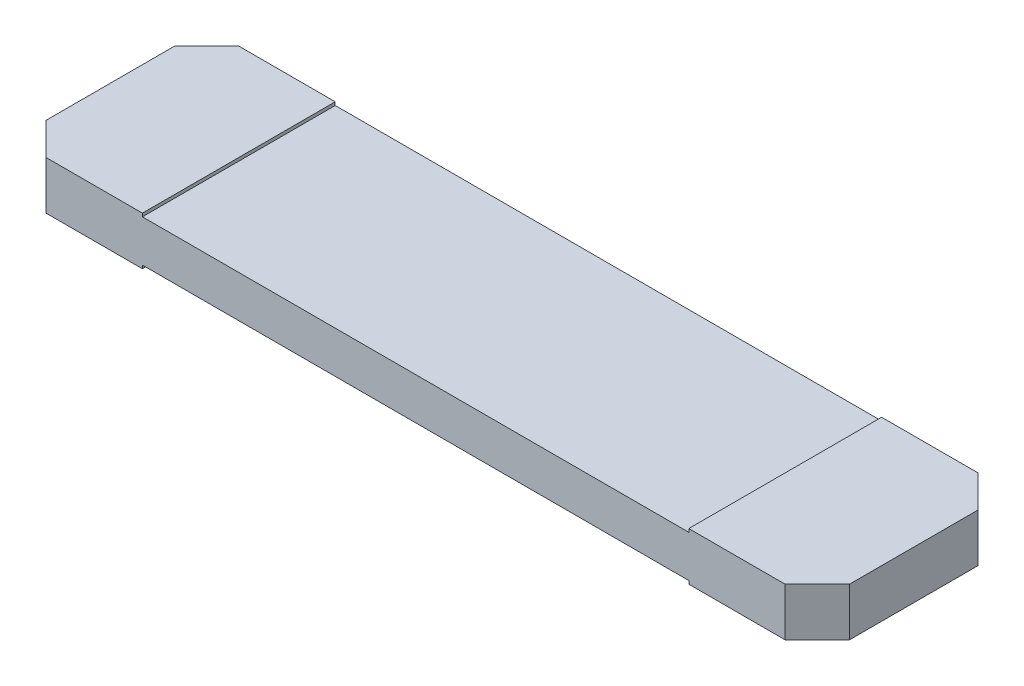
ISO-10303-21;
HEADER;
FILE_DESCRIPTION(('STEP AP214'),'2;1');
FILE_NAME('part.step','',(''),(''),'','','');
FILE_SCHEMA(('AUTOMOTIVE_DESIGN { 1 0 10303 214 1 1 1 1 }'));
ENDSEC;
DATA;
#1=APPLICATION_CONTEXT('core data for automotive mechanical design processes');
#2=APPLICATION_PROTOCOL_DEFINITION('international standard','automotive_design',2000,#1);
#3=PRODUCT_CONTEXT('',#1,'mechanical');
#4=PRODUCT('Part','Part','',(#3));
#5=PRODUCT_RELATED_PRODUCT_CATEGORY('part','',(#4));
#6=PRODUCT_DEFINITION_FORMATION('','',#4);
#7=PRODUCT_DEFINITION_CONTEXT('part definition',#1,'design');
#8=PRODUCT_DEFINITION('design','',#6,#7);
#9=PRODUCT_DEFINITION_SHAPE('','',#8);
#10=(LENGTH_UNIT() NAMED_UNIT(*) SI_UNIT(.MILLI.,.METRE.));
#11=(NAMED_UNIT(*) PLANE_ANGLE_UNIT() SI_UNIT($,.RADIAN.));
#12=(NAMED_UNIT(*) SI_UNIT($,.STERADIAN.) SOLID_ANGLE_UNIT());
#13=UNCERTAINTY_MEASURE_WITH_UNIT(LENGTH_MEASURE(1.E-05),#10,'distance_accuracy_value','');
#14=(GEOMETRIC_REPRESENTATION_CONTEXT(3) GLOBAL_UNCERTAINTY_ASSIGNED_CONTEXT((#13)) GLOBAL_UNIT_ASSIGNED_CONTEXT((#10,
#11,#12)) REPRESENTATION_CONTEXT('',''));
#15=CARTESIAN_POINT('',(0.,0.,0.));
#16=DIRECTION('',(0.,0.,1.));
#17=DIRECTION('',(1.,0.,0.));
#18=AXIS2_PLACEMENT_3D('',#15,#16,#17);
#19=CARTESIAN_POINT('',(-12.5,-0.75,-3.));
#20=DIRECTION('',(0.,-1.,0.));
#21=DIRECTION('',(0.,0.,-1.));
#22=AXIS2_PLACEMENT_3D('',#19,#20,#21);
#23=PLANE('',#22);
#24=DIRECTION('',(0.,0.,1.));
#25=VECTOR('',#24,1.);
#26=CARTESIAN_POINT('',(8.5,-0.75,-3.));
#27=LINE('',#26,#25);
#28=CARTESIAN_POINT('',(8.5,-0.75,-3.));
#29=VERTEX_POINT('',#28);
#30=CARTESIAN_POINT('',(8.5,-0.75,3.));
#31=VERTEX_POINT('',#30);
#32=EDGE_CURVE('E38',#29,#31,#27,.T.);
#33=ORIENTED_EDGE('',*,*,#32,.F.);
#34=DIRECTION('',(-1.,0.,0.));
#35=VECTOR('',#34,1.);
#36=CARTESIAN_POINT('',(-11.5,-0.75,-3.));
#37=LINE('',#36,#35);
#38=CARTESIAN_POINT('',(11.5,-0.75,-3.));
#39=VERTEX_POINT('',#38);
#40=EDGE_CURVE('E165',#39,#29,#37,.T.);
#41=ORIENTED_EDGE('',*,*,#40,.F.);
#42=DIRECTION('',(-0.707106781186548,0.,-0.707106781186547));
#43=VECTOR('',#42,1.);
#44=CARTESIAN_POINT('',(11.5,-0.75,-3.));
#45=LINE('',#44,#43);
#46=CARTESIAN_POINT('',(12.5,-0.75,-2.));
#47=VERTEX_POINT('',#46);
#48=EDGE_CURVE('E206',#47,#39,#45,.T.);
#49=ORIENTED_EDGE('',*,*,#48,.F.);
#50=DIRECTION('',(0.,0.,-1.));
#51=VECTOR('',#50,1.);
#52=CARTESIAN_POINT('',(12.5,-0.75,2.));
#53=LINE('',#52,#51);
#54=CARTESIAN_POINT('',(12.5,-0.75,2.));
#55=VERTEX_POINT('',#54);
#56=EDGE_CURVE('E204',#55,#47,#53,.T.);
#57=ORIENTED_EDGE('',*,*,#56,.F.);
#58=DIRECTION('',(0.707106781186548,0.,-0.707106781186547));
#59=VECTOR('',#58,1.);
#60=CARTESIAN_POINT('',(11.5,-0.75,3.));
#61=LINE('',#60,#59);
#62=CARTESIAN_POINT('',(11.5,-0.75,3.));
#63=VERTEX_POINT('',#62);
#64=EDGE_CURVE('E202',#63,#55,#61,.T.);
#65=ORIENTED_EDGE('',*,*,#64,.F.);
#66=DIRECTION('',(1.,0.,0.));
#67=VECTOR('',#66,1.);
#68=CARTESIAN_POINT('',(-11.5,-0.75,3.));
#69=LINE('',#68,#67);
#70=EDGE_CURVE('E198',#31,#63,#69,.T.);
#71=ORIENTED_EDGE('',*,*,#70,.F.);
#72=EDGE_LOOP('',(#33,#41,#49,#57,#65,#71));
#73=FACE_BOUND('',#72,.T.);
#74=ADVANCED_FACE('F30',(#73),#23,.T.);
#75=CARTESIAN_POINT('',(-12.5,0.75,-3.));
#76=DIRECTION('',(0.,-1.,0.));
#77=DIRECTION('',(0.,0.,-1.));
#78=AXIS2_PLACEMENT_3D('',#75,#76,#77);
#79=PLANE('',#78);
#80=DIRECTION('',(1.,0.,0.));
#81=VECTOR('',#80,1.);
#82=CARTESIAN_POINT('',(-11.5,0.75,3.));
#83=LINE('',#82,#81);
#84=CARTESIAN_POINT('',(-11.5,0.75,3.));
#85=VERTEX_POINT('',#84);
#86=CARTESIAN_POINT('',(-8.5,0.75,3.));
#87=VERTEX_POINT('',#86);
#88=EDGE_CURVE('E218',#85,#87,#83,.T.);
#89=ORIENTED_EDGE('',*,*,#88,.T.);
#90=DIRECTION('',(0.,0.,-1.));
#91=VECTOR('',#90,1.);
#92=CARTESIAN_POINT('',(-8.5,0.75,-3.));
#93=LINE('',#92,#91);
#94=CARTESIAN_POINT('',(-8.5,0.75,-3.));
#95=VERTEX_POINT('',#94);
#96=EDGE_CURVE('E258',#87,#95,#93,.T.);
#97=ORIENTED_EDGE('',*,*,#96,.T.);
#98=DIRECTION('',(-1.,0.,0.));
#99=VECTOR('',#98,1.);
#100=CARTESIAN_POINT('',(-11.5,0.75,-3.));
#101=LINE('',#100,#99);
#102=CARTESIAN_POINT('',(-11.5,0.75,-3.));
#103=VERTEX_POINT('',#102);
#104=EDGE_CURVE('E227',#95,#103,#101,.T.);
#105=ORIENTED_EDGE('',*,*,#104,.T.);
#106=DIRECTION('',(-0.707106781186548,0.,0.707106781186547));
#107=VECTOR('',#106,1.);
#108=CARTESIAN_POINT('',(-12.5,0.75,-2.));
#109=LINE('',#108,#107);
#110=CARTESIAN_POINT('',(-12.5,0.75,-2.));
#111=VERTEX_POINT('',#110);
#112=EDGE_CURVE('E231',#103,#111,#109,.T.);
#113=ORIENTED_EDGE('',*,*,#112,.T.);
#114=DIRECTION('',(0.,0.,1.));
#115=VECTOR('',#114,1.);
#116=CARTESIAN_POINT('',(-12.5,0.75,2.));
#117=LINE('',#116,#115);
#118=CARTESIAN_POINT('',(-12.5,0.75,2.));
#119=VERTEX_POINT('',#118);
#120=EDGE_CURVE('E212',#111,#119,#117,.T.);
#121=ORIENTED_EDGE('',*,*,#120,.T.);
#122=DIRECTION('',(0.707106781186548,0.,0.707106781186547));
#123=VECTOR('',#122,1.);
#124=CARTESIAN_POINT('',(-12.5,0.75,2.));
#125=LINE('',#124,#123);
#126=EDGE_CURVE('E215',#119,#85,#125,.T.);
#127=ORIENTED_EDGE('',*,*,#126,.T.);
#128=EDGE_LOOP('',(#89,#97,#105,#113,#121,#127));
#129=FACE_BOUND('',#128,.T.);
#130=ADVANCED_FACE('F297',(#129),#79,.F.);
#131=CARTESIAN_POINT('',(-12.5,0.75,2.));
#132=DIRECTION('',(1.,0.,0.));
#133=DIRECTION('',(0.,0.,-1.));
#134=AXIS2_PLACEMENT_3D('',#131,#132,#133);
#135=PLANE('',#134);
#136=DIRECTION('',(0.,0.,1.));
#137=VECTOR('',#136,1.);
#138=CARTESIAN_POINT('',(-12.5,-0.75,2.));
#139=LINE('',#138,#137);
#140=CARTESIAN_POINT('',(-12.5,-0.75,-2.));
#141=VERTEX_POINT('',#140);
#142=CARTESIAN_POINT('',(-12.5,-0.75,2.));
#143=VERTEX_POINT('',#142);
#144=EDGE_CURVE('E193',#141,#143,#139,.T.);
#145=ORIENTED_EDGE('',*,*,#144,.T.);
#146=DIRECTION('',(0.,-1.,0.));
#147=VECTOR('',#146,1.);
#148=CARTESIAN_POINT('',(-12.5,0.75,2.));
#149=LINE('',#148,#147);
#150=EDGE_CURVE('E253',#119,#143,#149,.T.);
#151=ORIENTED_EDGE('',*,*,#150,.F.);
#152=ORIENTED_EDGE('',*,*,#120,.F.);
#153=DIRECTION('',(0.,-1.,0.));
#154=VECTOR('',#153,1.);
#155=CARTESIAN_POINT('',(-12.5,0.75,-2.));
#156=LINE('',#155,#154);
#157=EDGE_CURVE('E233',#111,#141,#156,.T.);
#158=ORIENTED_EDGE('',*,*,#157,.T.);
#159=EDGE_LOOP('',(#145,#151,#152,#158));
#160=FACE_BOUND('',#159,.T.);
#161=ADVANCED_FACE('F32',(#160),#135,.F.);
#162=CARTESIAN_POINT('',(-12.5,0.75,2.));
#163=DIRECTION('',(0.707106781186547,0.,-0.707106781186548));
#164=DIRECTION('',(-0.707106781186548,0.,-0.707106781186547));
#165=AXIS2_PLACEMENT_3D('',#162,#163,#164);
#166=PLANE('',#165);
#167=DIRECTION('',(0.707106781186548,0.,0.707106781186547));
#168=VECTOR('',#167,1.);
#169=CARTESIAN_POINT('',(-12.5,-0.75,2.));
#170=LINE('',#169,#168);
#171=CARTESIAN_POINT('',(-11.5,-0.75,3.));
#172=VERTEX_POINT('',#171);
#173=EDGE_CURVE('E196',#143,#172,#170,.T.);
#174=ORIENTED_EDGE('',*,*,#173,.T.);
#175=DIRECTION('',(0.,-1.,0.));
#176=VECTOR('',#175,1.);
#177=CARTESIAN_POINT('',(-11.5,0.75,3.));
#178=LINE('',#177,#176);
#179=EDGE_CURVE('E250',#85,#172,#178,.T.);
#180=ORIENTED_EDGE('',*,*,#179,.F.);
#181=ORIENTED_EDGE('',*,*,#126,.F.);
#182=ORIENTED_EDGE('',*,*,#150,.T.);
#183=EDGE_LOOP('',(#174,#180,#181,#182));
#184=FACE_BOUND('',#183,.T.);
#185=ADVANCED_FACE('F310',(#184),#166,.F.);
#186=CARTESIAN_POINT('',(-11.5,0.75,3.));
#187=DIRECTION('',(0.,0.,-1.));
#188=DIRECTION('',(-1.,0.,0.));
#189=AXIS2_PLACEMENT_3D('',#186,#187,#188);
#190=PLANE('',#189);
#191=DIRECTION('',(1.,0.,0.));
#192=VECTOR('',#191,1.);
#193=CARTESIAN_POINT('',(-11.5,-0.650000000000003,3.));
#194=LINE('',#193,#192);
#195=CARTESIAN_POINT('',(-8.5,-0.650000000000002,3.));
#196=VERTEX_POINT('',#195);
#197=CARTESIAN_POINT('',(8.5,-0.65,3.));
#198=VERTEX_POINT('',#197);
#199=EDGE_CURVE('E156',#196,#198,#194,.T.);
#200=ORIENTED_EDGE('',*,*,#199,.T.);
#201=DIRECTION('',(0.,-1.,0.));
#202=VECTOR('',#201,1.);
#203=CARTESIAN_POINT('',(8.5,0.75,3.));
#204=LINE('',#203,#202);
#205=EDGE_CURVE('E168',#198,#31,#204,.T.);
#206=ORIENTED_EDGE('',*,*,#205,.T.);
#207=ORIENTED_EDGE('',*,*,#70,.T.);
#208=DIRECTION('',(0.,-1.,0.));
#209=VECTOR('',#208,1.);
#210=CARTESIAN_POINT('',(11.5,0.75,3.));
#211=LINE('',#210,#209);
#212=CARTESIAN_POINT('',(11.5,0.75,3.));
#213=VERTEX_POINT('',#212);
#214=EDGE_CURVE('E247',#213,#63,#211,.T.);
#215=ORIENTED_EDGE('',*,*,#214,.F.);
#216=CARTESIAN_POINT('',(8.5,0.75,3.));
#217=VERTEX_POINT('',#216);
#218=EDGE_CURVE('E217',#217,#213,#83,.T.);
#219=ORIENTED_EDGE('',*,*,#218,.F.);
#220=DIRECTION('',(0.,-1.,0.));
#221=VECTOR('',#220,1.);
#222=CARTESIAN_POINT('',(8.5,0.75,3.));
#223=LINE('',#222,#221);
#224=CARTESIAN_POINT('',(8.5,0.65,3.));
#225=VERTEX_POINT('',#224);
#226=EDGE_CURVE('E53',#217,#225,#223,.T.);
#227=ORIENTED_EDGE('',*,*,#226,.T.);
#228=DIRECTION('',(-1.,0.,0.));
#229=VECTOR('',#228,1.);
#230=CARTESIAN_POINT('',(-11.5,0.65,3.));
#231=LINE('',#230,#229);
#232=CARTESIAN_POINT('',(-8.5,0.65,3.));
#233=VERTEX_POINT('',#232);
#234=EDGE_CURVE('E190',#225,#233,#231,.T.);
#235=ORIENTED_EDGE('',*,*,#234,.T.);
#236=DIRECTION('',(0.,1.,0.));
#237=VECTOR('',#236,1.);
#238=CARTESIAN_POINT('',(-8.5,0.75,3.));
#239=LINE('',#238,#237);
#240=EDGE_CURVE('E187',#233,#87,#239,.T.);
#241=ORIENTED_EDGE('',*,*,#240,.T.);
#242=ORIENTED_EDGE('',*,*,#88,.F.);
#243=ORIENTED_EDGE('',*,*,#179,.T.);
#244=CARTESIAN_POINT('',(-8.5,-0.75,3.));
#245=VERTEX_POINT('',#244);
#246=EDGE_CURVE('E199',#172,#245,#69,.T.);
#247=ORIENTED_EDGE('',*,*,#246,.T.);
#248=DIRECTION('',(0.,1.,0.));
#249=VECTOR('',#248,1.);
#250=CARTESIAN_POINT('',(-8.49999999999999,0.749999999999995,3.));
#251=LINE('',#250,#249);
#252=EDGE_CURVE('E45',#245,#196,#251,.T.);
#253=ORIENTED_EDGE('',*,*,#252,.T.);
#254=EDGE_LOOP('',(#200,#206,#207,#215,#219,#227,#235,#241,#242,#243,#247,#253));
#255=FACE_BOUND('',#254,.T.);
#256=ADVANCED_FACE('F268',(#255),#190,.F.);
#257=CARTESIAN_POINT('',(11.5,0.75,3.));
#258=DIRECTION('',(-0.707106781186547,0.,-0.707106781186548));
#259=DIRECTION('',(-0.707106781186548,0.,0.707106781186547));
#260=AXIS2_PLACEMENT_3D('',#257,#258,#259);
#261=PLANE('',#260);
#262=ORIENTED_EDGE('',*,*,#64,.T.);
#263=DIRECTION('',(0.,-1.,0.));
#264=VECTOR('',#263,1.);
#265=CARTESIAN_POINT('',(12.5,0.75,2.));
#266=LINE('',#265,#264);
#267=CARTESIAN_POINT('',(12.5,0.75,2.));
#268=VERTEX_POINT('',#267);
#269=EDGE_CURVE('E244',#268,#55,#266,.T.);
#270=ORIENTED_EDGE('',*,*,#269,.F.);
#271=DIRECTION('',(0.707106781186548,0.,-0.707106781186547));
#272=VECTOR('',#271,1.);
#273=CARTESIAN_POINT('',(11.5,0.75,3.));
#274=LINE('',#273,#272);
#275=EDGE_CURVE('E221',#213,#268,#274,.T.);
#276=ORIENTED_EDGE('',*,*,#275,.F.);
#277=ORIENTED_EDGE('',*,*,#214,.T.);
#278=EDGE_LOOP('',(#262,#270,#276,#277));
#279=FACE_BOUND('',#278,.T.);
#280=ADVANCED_FACE('F275',(#279),#261,.F.);
#281=CARTESIAN_POINT('',(12.5,0.75,2.));
#282=DIRECTION('',(-1.,0.,0.));
#283=DIRECTION('',(0.,0.,1.));
#284=AXIS2_PLACEMENT_3D('',#281,#282,#283);
#285=PLANE('',#284);
#286=ORIENTED_EDGE('',*,*,#56,.T.);
#287=DIRECTION('',(0.,-1.,0.));
#288=VECTOR('',#287,1.);
#289=CARTESIAN_POINT('',(12.5,0.75,-2.));
#290=LINE('',#289,#288);
#291=CARTESIAN_POINT('',(12.5,0.75,-2.));
#292=VERTEX_POINT('',#291);
#293=EDGE_CURVE('E241',#292,#47,#290,.T.);
#294=ORIENTED_EDGE('',*,*,#293,.F.);
#295=DIRECTION('',(0.,0.,-1.));
#296=VECTOR('',#295,1.);
#297=CARTESIAN_POINT('',(12.5,0.75,2.));
#298=LINE('',#297,#296);
#299=EDGE_CURVE('E223',#268,#292,#298,.T.);
#300=ORIENTED_EDGE('',*,*,#299,.F.);
#301=ORIENTED_EDGE('',*,*,#269,.T.);
#302=EDGE_LOOP('',(#286,#294,#300,#301));
#303=FACE_BOUND('',#302,.T.);
#304=ADVANCED_FACE('F279',(#303),#285,.F.);
#305=CARTESIAN_POINT('',(11.5,0.75,-3.));
#306=DIRECTION('',(-0.707106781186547,0.,0.707106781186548));
#307=DIRECTION('',(0.707106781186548,0.,0.707106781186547));
#308=AXIS2_PLACEMENT_3D('',#305,#306,#307);
#309=PLANE('',#308);
#310=ORIENTED_EDGE('',*,*,#48,.T.);
#311=DIRECTION('',(0.,-1.,0.));
#312=VECTOR('',#311,1.);
#313=CARTESIAN_POINT('',(11.5,0.75,-3.));
#314=LINE('',#313,#312);
#315=CARTESIAN_POINT('',(11.5,0.75,-3.));
#316=VERTEX_POINT('',#315);
#317=EDGE_CURVE('E239',#316,#39,#314,.T.);
#318=ORIENTED_EDGE('',*,*,#317,.F.);
#319=DIRECTION('',(-0.707106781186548,0.,-0.707106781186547));
#320=VECTOR('',#319,1.);
#321=CARTESIAN_POINT('',(11.5,0.75,-3.));
#322=LINE('',#321,#320);
#323=EDGE_CURVE('E225',#292,#316,#322,.T.);
#324=ORIENTED_EDGE('',*,*,#323,.F.);
#325=ORIENTED_EDGE('',*,*,#293,.T.);
#326=EDGE_LOOP('',(#310,#318,#324,#325));
#327=FACE_BOUND('',#326,.T.);
#328=ADVANCED_FACE('F336',(#327),#309,.F.);
#329=CARTESIAN_POINT('',(-11.5,0.75,-3.));
#330=DIRECTION('',(0.,0.,1.));
#331=DIRECTION('',(1.,0.,0.));
#332=AXIS2_PLACEMENT_3D('',#329,#330,#331);
#333=PLANE('',#332);
#334=ORIENTED_EDGE('',*,*,#40,.T.);
#335=DIRECTION('',(0.,1.,0.));
#336=VECTOR('',#335,1.);
#337=CARTESIAN_POINT('',(8.5,0.75,-3.));
#338=LINE('',#337,#336);
#339=CARTESIAN_POINT('',(8.5,-0.65,-3.));
#340=VERTEX_POINT('',#339);
#341=EDGE_CURVE('E162',#29,#340,#338,.T.);
#342=ORIENTED_EDGE('',*,*,#341,.T.);
#343=DIRECTION('',(-1.,0.,0.));
#344=VECTOR('',#343,1.);
#345=CARTESIAN_POINT('',(-11.5,-0.650000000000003,-3.));
#346=LINE('',#345,#344);
#347=CARTESIAN_POINT('',(-8.5,-0.650000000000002,-3.));
#348=VERTEX_POINT('',#347);
#349=EDGE_CURVE('E11',#340,#348,#346,.T.);
#350=ORIENTED_EDGE('',*,*,#349,.T.);
#351=DIRECTION('',(0.,-1.,0.));
#352=VECTOR('',#351,1.);
#353=CARTESIAN_POINT('',(-8.49999999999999,0.749999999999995,-3.));
#354=LINE('',#353,#352);
#355=CARTESIAN_POINT('',(-8.5,-0.75,-3.));
#356=VERTEX_POINT('',#355);
#357=EDGE_CURVE('E143',#348,#356,#354,.T.);
#358=ORIENTED_EDGE('',*,*,#357,.T.);
#359=CARTESIAN_POINT('',(-11.5,-0.75,-3.));
#360=VERTEX_POINT('',#359);
#361=EDGE_CURVE('E208',#356,#360,#37,.T.);
#362=ORIENTED_EDGE('',*,*,#361,.T.);
#363=DIRECTION('',(0.,-1.,0.));
#364=VECTOR('',#363,1.);
#365=CARTESIAN_POINT('',(-11.5,0.75,-3.));
#366=LINE('',#365,#364);
#367=EDGE_CURVE('E236',#103,#360,#366,.T.);
#368=ORIENTED_EDGE('',*,*,#367,.F.);
#369=ORIENTED_EDGE('',*,*,#104,.F.);
#370=DIRECTION('',(0.,-1.,0.));
#371=VECTOR('',#370,1.);
#372=CARTESIAN_POINT('',(-8.5,0.75,-3.));
#373=LINE('',#372,#371);
#374=CARTESIAN_POINT('',(-8.5,0.65,-3.));
#375=VERTEX_POINT('',#374);
#376=EDGE_CURVE('E184',#95,#375,#373,.T.);
#377=ORIENTED_EDGE('',*,*,#376,.T.);
#378=DIRECTION('',(1.,0.,0.));
#379=VECTOR('',#378,1.);
#380=CARTESIAN_POINT('',(-11.5,0.65,-3.));
#381=LINE('',#380,#379);
#382=CARTESIAN_POINT('',(8.5,0.65,-3.));
#383=VERTEX_POINT('',#382);
#384=EDGE_CURVE('E261',#375,#383,#381,.T.);
#385=ORIENTED_EDGE('',*,*,#384,.T.);
#386=DIRECTION('',(0.,1.,0.));
#387=VECTOR('',#386,1.);
#388=CARTESIAN_POINT('',(8.5,0.75,-3.));
#389=LINE('',#388,#387);
#390=CARTESIAN_POINT('',(8.5,0.75,-3.));
#391=VERTEX_POINT('',#390);
#392=EDGE_CURVE('E178',#383,#391,#389,.T.);
#393=ORIENTED_EDGE('',*,*,#392,.T.);
#394=EDGE_CURVE('E228',#316,#391,#101,.T.);
#395=ORIENTED_EDGE('',*,*,#394,.F.);
#396=ORIENTED_EDGE('',*,*,#317,.T.);
#397=EDGE_LOOP('',(#334,#342,#350,#358,#362,#368,#369,#377,#385,#393,#395,#396));
#398=FACE_BOUND('',#397,.T.);
#399=ADVANCED_FACE('F161',(#398),#333,.F.);
#400=CARTESIAN_POINT('',(-12.5,0.75,-2.));
#401=DIRECTION('',(0.707106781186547,0.,0.707106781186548));
#402=DIRECTION('',(0.707106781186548,0.,-0.707106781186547));
#403=AXIS2_PLACEMENT_3D('',#400,#401,#402);
#404=PLANE('',#403);
#405=DIRECTION('',(-0.707106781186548,0.,0.707106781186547));
#406=VECTOR('',#405,1.);
#407=CARTESIAN_POINT('',(-12.5,-0.75,-2.));
#408=LINE('',#407,#406);
#409=EDGE_CURVE('E210',#360,#141,#408,.T.);
#410=ORIENTED_EDGE('',*,*,#409,.T.);
#411=ORIENTED_EDGE('',*,*,#157,.F.);
#412=ORIENTED_EDGE('',*,*,#112,.F.);
#413=ORIENTED_EDGE('',*,*,#367,.T.);
#414=EDGE_LOOP('',(#410,#411,#412,#413));
#415=FACE_BOUND('',#414,.T.);
#416=ADVANCED_FACE('F303',(#415),#404,.F.);
#417=ORIENTED_EDGE('',*,*,#394,.T.);
#418=DIRECTION('',(0.,0.,1.));
#419=VECTOR('',#418,1.);
#420=CARTESIAN_POINT('',(8.5,0.75,-3.));
#421=LINE('',#420,#419);
#422=EDGE_CURVE('E256',#391,#217,#421,.T.);
#423=ORIENTED_EDGE('',*,*,#422,.T.);
#424=ORIENTED_EDGE('',*,*,#218,.T.);
#425=ORIENTED_EDGE('',*,*,#275,.T.);
#426=ORIENTED_EDGE('',*,*,#299,.T.);
#427=ORIENTED_EDGE('',*,*,#323,.T.);
#428=EDGE_LOOP('',(#417,#423,#424,#425,#426,#427));
#429=FACE_BOUND('',#428,.T.);
#430=ADVANCED_FACE('F283',(#429),#79,.F.);
#431=DIRECTION('',(0.,0.,-1.));
#432=VECTOR('',#431,1.);
#433=CARTESIAN_POINT('',(-8.5,-0.75,-3.));
#434=LINE('',#433,#432);
#435=EDGE_CURVE('E147',#245,#356,#434,.T.);
#436=ORIENTED_EDGE('',*,*,#435,.F.);
#437=ORIENTED_EDGE('',*,*,#246,.F.);
#438=ORIENTED_EDGE('',*,*,#173,.F.);
#439=ORIENTED_EDGE('',*,*,#144,.F.);
#440=ORIENTED_EDGE('',*,*,#409,.F.);
#441=ORIENTED_EDGE('',*,*,#361,.F.);
#442=EDGE_LOOP('',(#436,#437,#438,#439,#440,#441));
#443=FACE_BOUND('',#442,.T.);
#444=ADVANCED_FACE('F313',(#443),#23,.T.);
#445=CARTESIAN_POINT('',(-8.5,0.65,-10.75));
#446=DIRECTION('',(0.,-1.,0.));
#447=DIRECTION('',(0.,0.,-1.));
#448=AXIS2_PLACEMENT_3D('',#445,#446,#447);
#449=PLANE('',#448);
#450=DIRECTION('',(0.,0.,1.));
#451=VECTOR('',#450,1.);
#452=CARTESIAN_POINT('',(8.5,0.65,-10.75));
#453=LINE('',#452,#451);
#454=EDGE_CURVE('E176',#383,#225,#453,.T.);
#455=ORIENTED_EDGE('',*,*,#454,.F.);
#456=ORIENTED_EDGE('',*,*,#384,.F.);
#457=DIRECTION('',(0.,0.,1.));
#458=VECTOR('',#457,1.);
#459=CARTESIAN_POINT('',(-8.5,0.65,-10.75));
#460=LINE('',#459,#458);
#461=EDGE_CURVE('E175',#375,#233,#460,.T.);
#462=ORIENTED_EDGE('',*,*,#461,.T.);
#463=ORIENTED_EDGE('',*,*,#234,.F.);
#464=EDGE_LOOP('',(#455,#456,#462,#463));
#465=FACE_BOUND('',#464,.T.);
#466=ADVANCED_FACE('F289',(#465),#449,.F.);
#467=CARTESIAN_POINT('',(-8.5,2.65,-10.75));
#468=DIRECTION('',(-1.,0.,0.));
#469=DIRECTION('',(0.,0.,1.));
#470=AXIS2_PLACEMENT_3D('',#467,#468,#469);
#471=PLANE('',#470);
#472=ORIENTED_EDGE('',*,*,#461,.F.);
#473=ORIENTED_EDGE('',*,*,#376,.F.);
#474=ORIENTED_EDGE('',*,*,#96,.F.);
#475=ORIENTED_EDGE('',*,*,#240,.F.);
#476=EDGE_LOOP('',(#472,#473,#474,#475));
#477=FACE_BOUND('',#476,.T.);
#478=ADVANCED_FACE('F295',(#477),#471,.F.);
#479=CARTESIAN_POINT('',(8.5,2.65,-10.75));
#480=DIRECTION('',(1.,0.,0.));
#481=DIRECTION('',(0.,0.,-1.));
#482=AXIS2_PLACEMENT_3D('',#479,#480,#481);
#483=PLANE('',#482);
#484=ORIENTED_EDGE('',*,*,#422,.F.);
#485=ORIENTED_EDGE('',*,*,#392,.F.);
#486=ORIENTED_EDGE('',*,*,#454,.T.);
#487=ORIENTED_EDGE('',*,*,#226,.F.);
#488=EDGE_LOOP('',(#484,#485,#486,#487));
#489=FACE_BOUND('',#488,.T.);
#490=ADVANCED_FACE('F291',(#489),#483,.F.);
#491=CARTESIAN_POINT('',(8.5,-0.65,-10.75));
#492=DIRECTION('',(0.,1.,0.));
#493=DIRECTION('',(-1.,0.,0.));
#494=AXIS2_PLACEMENT_3D('',#491,#492,#493);
#495=PLANE('',#494);
#496=DIRECTION('',(0.,0.,1.));
#497=VECTOR('',#496,1.);
#498=CARTESIAN_POINT('',(-8.5,-0.650000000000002,-10.75));
#499=LINE('',#498,#497);
#500=EDGE_CURVE('E146',#348,#196,#499,.T.);
#501=ORIENTED_EDGE('',*,*,#500,.F.);
#502=ORIENTED_EDGE('',*,*,#349,.F.);
#503=DIRECTION('',(0.,0.,1.));
#504=VECTOR('',#503,1.);
#505=CARTESIAN_POINT('',(8.5,-0.65,-10.75));
#506=LINE('',#505,#504);
#507=EDGE_CURVE('E157',#340,#198,#506,.T.);
#508=ORIENTED_EDGE('',*,*,#507,.T.);
#509=ORIENTED_EDGE('',*,*,#199,.F.);
#510=EDGE_LOOP('',(#501,#502,#508,#509));
#511=FACE_BOUND('',#510,.T.);
#512=ADVANCED_FACE('F152',(#511),#495,.F.);
#513=CARTESIAN_POINT('',(8.5,-2.65,-10.75));
#514=DIRECTION('',(1.,0.,0.));
#515=DIRECTION('',(0.,0.,-1.));
#516=AXIS2_PLACEMENT_3D('',#513,#514,#515);
#517=PLANE('',#516);
#518=ORIENTED_EDGE('',*,*,#507,.F.);
#519=ORIENTED_EDGE('',*,*,#341,.F.);
#520=ORIENTED_EDGE('',*,*,#32,.T.);
#521=ORIENTED_EDGE('',*,*,#205,.F.);
#522=EDGE_LOOP('',(#518,#519,#520,#521));
#523=FACE_BOUND('',#522,.T.);
#524=ADVANCED_FACE('F264',(#523),#517,.F.);
#525=CARTESIAN_POINT('',(-8.5,-2.65,-10.75));
#526=DIRECTION('',(-1.,0.,0.));
#527=DIRECTION('',(0.,-1.,0.));
#528=AXIS2_PLACEMENT_3D('',#525,#526,#527);
#529=PLANE('',#528);
#530=ORIENTED_EDGE('',*,*,#435,.T.);
#531=ORIENTED_EDGE('',*,*,#357,.F.);
#532=ORIENTED_EDGE('',*,*,#500,.T.);
#533=ORIENTED_EDGE('',*,*,#252,.F.);
#534=EDGE_LOOP('',(#530,#531,#532,#533));
#535=FACE_BOUND('',#534,.T.);
#536=ADVANCED_FACE('F145',(#535),#529,.F.);
#537=CLOSED_SHELL('',(#74,#130,#161,#185,#256,#280,#304,#328,#399,#416,#430,#444,#466,#478,#490,
#512,#524,#536));
#538=MANIFOLD_SOLID_BREP('B2',#537);
#539=ADVANCED_BREP_SHAPE_REPRESENTATION('',(#18,#538),#14);
#540=SHAPE_DEFINITION_REPRESENTATION(#9,#539);
ENDSEC;
END-ISO-10303-21;
